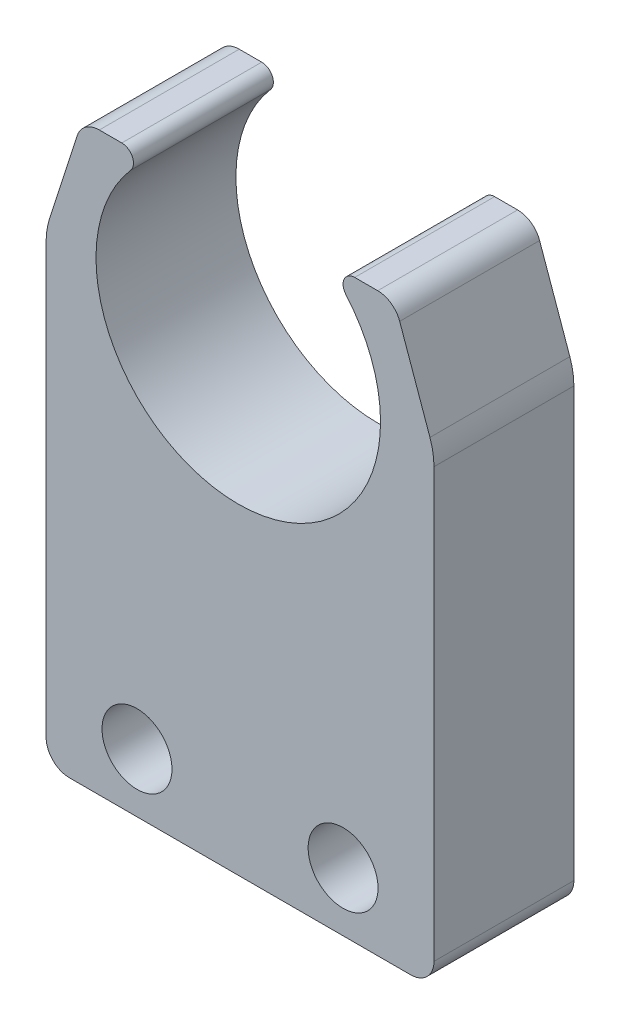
from build123d import *

# Parameters (mm, degrees)
SKETCH1_R           = 1.5
BOSS_EXTRUDE1_DEPTH = 6


with BuildPart() as part:
    # Sketch1 → Boss-Extrude1 (new body)
    with BuildSketch(Plane.XY):
        with BuildLine():
            Line((-233.27634119, 43.09271817), (-232.312455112, 43.09271817))
            ThreePointArc((-232.312455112, 43.09271817), (-231.857784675, 42.800744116), (-231.934122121, 42.265817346))
            ThreePointArc((-231.934122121, 42.265817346), (-227.318459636, 32.177627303), (-222.702797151, 42.265817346))
            ThreePointArc((-222.702797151, 42.265817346), (-222.779134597, 42.800744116), (-222.32446416, 43.09271817))
            Line((-222.32446416, 43.09271817), (-221.339044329, 43.09271817))
            ThreePointArc((-221.339044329, 43.09271817), (-220.761966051, 42.909407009), (-220.39645755, 42.426679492))
            Line((-220.39645755, 42.426679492), (-219.098675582, 38.763763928))
            ThreePointArc((-219.098675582, 38.763763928), (-218.969809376, 38.270170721), (-218.926435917, 37.761879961))
            Line((-218.926435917, 37.761879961), (-218.926435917, 19.392564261))
            ThreePointArc((-218.926435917, 19.392564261), (-219.219329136, 18.68545748), (-219.926435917, 18.392564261))
            Line((-219.926435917, 18.392564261), (-234.557876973, 18.392564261))
            ThreePointArc((-234.557876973, 18.392564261), (-235.264983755, 18.68545748), (-235.557876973, 19.392564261))
            Line((-235.557876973, 19.392564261), (-235.557876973, 37.805688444))
            ThreePointArc((-235.557876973, 37.805688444), (-235.521431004, 38.27189388), (-235.412978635, 38.726771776))
            Line((-235.412978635, 38.726771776), (-234.228041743, 42.399745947))
            ThreePointArc((-234.228041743, 42.399745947), (-233.864971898, 42.901120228), (-233.27634119, 43.09271817))
        make_face()
        with Locations((-231.660791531, 20.912192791)):
            Circle(SKETCH1_R, mode=Mode.SUBTRACT)
        with Locations(Location((-222.82352136, 20.912192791, 0), (0, 0, 180))):
            Circle(SKETCH1_R, mode=Mode.SUBTRACT)
    extrude(amount=BOSS_EXTRUDE1_DEPTH)


solid = part.part
